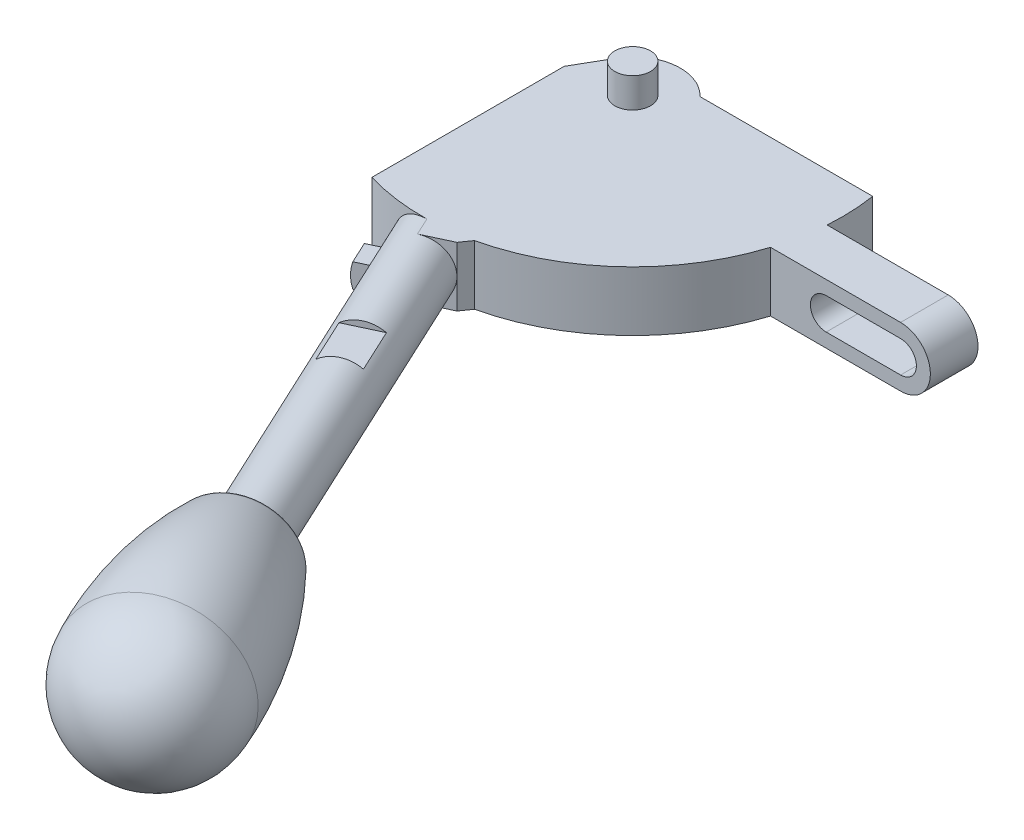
ISO-10303-21;
HEADER;
FILE_DESCRIPTION(('STEP AP214'),'2;1');
FILE_NAME('part.step','',(''),(''),'','','');
FILE_SCHEMA(('AUTOMOTIVE_DESIGN { 1 0 10303 214 1 1 1 1 }'));
ENDSEC;
DATA;
#1=APPLICATION_CONTEXT('core data for automotive mechanical design processes');
#2=APPLICATION_PROTOCOL_DEFINITION('international standard','automotive_design',2000,#1);
#3=PRODUCT_CONTEXT('',#1,'mechanical');
#4=PRODUCT('Part','Part','',(#3));
#5=PRODUCT_RELATED_PRODUCT_CATEGORY('part','',(#4));
#6=PRODUCT_DEFINITION_FORMATION('','',#4);
#7=PRODUCT_DEFINITION_CONTEXT('part definition',#1,'design');
#8=PRODUCT_DEFINITION('design','',#6,#7);
#9=PRODUCT_DEFINITION_SHAPE('','',#8);
#10=(LENGTH_UNIT() NAMED_UNIT(*) SI_UNIT(.MILLI.,.METRE.));
#11=(NAMED_UNIT(*) PLANE_ANGLE_UNIT() SI_UNIT($,.RADIAN.));
#12=(NAMED_UNIT(*) SI_UNIT($,.STERADIAN.) SOLID_ANGLE_UNIT());
#13=UNCERTAINTY_MEASURE_WITH_UNIT(LENGTH_MEASURE(1.E-05),#10,'distance_accuracy_value','');
#14=(GEOMETRIC_REPRESENTATION_CONTEXT(3) GLOBAL_UNCERTAINTY_ASSIGNED_CONTEXT((#13)) GLOBAL_UNIT_ASSIGNED_CONTEXT((#10,
#11,#12)) REPRESENTATION_CONTEXT('',''));
#15=CARTESIAN_POINT('',(0.,0.,0.));
#16=DIRECTION('',(0.,0.,1.));
#17=DIRECTION('',(1.,0.,0.));
#18=AXIS2_PLACEMENT_3D('',#15,#16,#17);
#19=CARTESIAN_POINT('',(40.5255103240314,0.,120.692352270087));
#20=DIRECTION('',(-0.905029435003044,-0.053094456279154,0.422022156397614));
#21=DIRECTION('',(0.422618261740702,0.,0.906307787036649));
#22=AXIS2_PLACEMENT_3D('',#19,#20,#21);
#23=SPHERICAL_SURFACE('',#22,13.);
#24=CARTESIAN_POINT('',(40.5255103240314,0.,120.692352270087));
#25=DIRECTION('',(-0.422618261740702,0.,-0.906307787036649));
#26=DIRECTION('',(-0.905029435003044,-0.053094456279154,0.422022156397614));
#27=AXIS2_PLACEMENT_3D('',#24,#25,#26);
#28=SPHERICAL_SURFACE('',#27,13.);
#29=CARTESIAN_POINT('',(40.5255103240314,0.,120.692352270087));
#30=DIRECTION('',(-0.422618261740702,0.,-0.906307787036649));
#31=DIRECTION('',(-0.905029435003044,-0.053094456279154,0.422022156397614));
#32=AXIS2_PLACEMENT_3D('',#29,#30,#31);
#33=CIRCLE('',#32,13.);
#34=CARTESIAN_POINT('',(28.7601276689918,-0.690227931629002,126.178640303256));
#35=VERTEX_POINT('',#34);
#36=EDGE_CURVE('E627',#35,#35,#33,.T.);
#37=ORIENTED_EDGE('',*,*,#36,.F.);
#38=EDGE_LOOP('',(#37));
#39=FACE_BOUND('',#38,.T.);
#40=ADVANCED_FACE('F15',(#39),#28,.T.);
#41=CARTESIAN_POINT('',(39.4938461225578,0.,118.479941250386));
#42=DIRECTION('',(-0.422618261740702,0.,-0.906307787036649));
#43=DIRECTION('',(-0.905029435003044,-0.053094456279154,0.422022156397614));
#44=AXIS2_PLACEMENT_3D('',#41,#42,#43);
#45=DEGENERATE_TOROIDAL_SURFACE('',#44,66.9627469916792,80.,.F.);
#46=CARTESIAN_POINT('',(28.5554692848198,0.,95.0225164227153));
#47=DIRECTION('',(-0.422618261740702,0.,-0.906307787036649));
#48=DIRECTION('',(-0.905029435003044,-0.053094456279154,0.422022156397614));
#49=AXIS2_PLACEMENT_3D('',#46,#47,#48);
#50=CIRCLE('',#49,8.73468448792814);
#51=CARTESIAN_POINT('',(20.6503227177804,-0.463763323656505,98.7087468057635));
#52=VERTEX_POINT('',#51);
#53=EDGE_CURVE('E629',#52,#52,#50,.T.);
#54=ORIENTED_EDGE('',*,*,#53,.F.);
#55=EDGE_LOOP('',(#54));
#56=FACE_BOUND('',#55,.T.);
#57=ORIENTED_EDGE('',*,*,#36,.T.);
#58=EDGE_LOOP('',(#57));
#59=FACE_BOUND('',#58,.T.);
#60=ADVANCED_FACE('F600',(#56,#59),#45,.F.);
#61=CARTESIAN_POINT('',(28.6921989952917,0.,95.3157342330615));
#62=DIRECTION('',(-0.422618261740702,0.,-0.906307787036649));
#63=DIRECTION('',(-0.905029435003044,-0.053094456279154,0.422022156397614));
#64=AXIS2_PLACEMENT_3D('',#61,#62,#63);
#65=TOROIDAL_SURFACE('',#64,7.78846659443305,1.);
#66=CARTESIAN_POINT('',(28.269580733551,0.,94.4094264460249));
#67=DIRECTION('',(-0.422618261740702,0.,-0.906307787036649));
#68=DIRECTION('',(-0.905029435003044,-0.053094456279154,0.422022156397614));
#69=AXIS2_PLACEMENT_3D('',#66,#67,#68);
#70=CIRCLE('',#69,7.78846659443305);
#71=CARTESIAN_POINT('',(21.2207892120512,-0.413524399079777,97.6963319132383));
#72=VERTEX_POINT('',#71);
#73=EDGE_CURVE('E25',#72,#72,#70,.T.);
#74=ORIENTED_EDGE('',*,*,#73,.F.);
#75=EDGE_LOOP('',(#74));
#76=FACE_BOUND('',#75,.T.);
#77=ORIENTED_EDGE('',*,*,#53,.T.);
#78=EDGE_LOOP('',(#77));
#79=FACE_BOUND('',#78,.T.);
#80=ADVANCED_FACE('F456',(#76,#79),#65,.T.);
#81=CARTESIAN_POINT('',(27.8948003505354,7.77748092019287,94.5841894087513));
#82=DIRECTION('',(0.422618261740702,0.,0.906307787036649));
#83=DIRECTION('',(0.905029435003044,0.053094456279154,-0.422022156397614));
#84=AXIS2_PLACEMENT_3D('',#81,#82,#83);
#85=PLANE('',#84);
#86=ORIENTED_EDGE('',*,*,#73,.T.);
#87=EDGE_LOOP('',(#86));
#88=FACE_BOUND('',#87,.T.);
#89=CARTESIAN_POINT('',(28.269580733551,0.,94.4094264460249));
#90=DIRECTION('',(0.422618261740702,0.,0.906307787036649));
#91=DIRECTION('',(-0.906307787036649,0.,0.422618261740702));
#92=AXIS2_PLACEMENT_3D('',#89,#90,#91);
#93=CIRCLE('',#92,5.);
#94=CARTESIAN_POINT('',(23.7380417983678,0.,96.5225177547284));
#95=VERTEX_POINT('',#94);
#96=EDGE_CURVE('E9',#95,#95,#93,.F.);
#97=ORIENTED_EDGE('',*,*,#96,.F.);
#98=EDGE_LOOP('',(#97));
#99=FACE_BOUND('',#98,.T.);
#100=ADVANCED_FACE('F444',(#88,#99),#85,.F.);
#101=CARTESIAN_POINT('',(0.,10.,0.));
#102=DIRECTION('',(0.,-1.,0.));
#103=DIRECTION('',(0.,0.,-1.));
#104=AXIS2_PLACEMENT_3D('',#101,#102,#103);
#105=PLANE('',#104);
#106=CARTESIAN_POINT('',(0.,10.,0.));
#107=DIRECTION('',(0.,-1.,0.));
#108=DIRECTION('',(0.,0.,-1.));
#109=AXIS2_PLACEMENT_3D('',#106,#107,#108);
#110=CIRCLE('',#109,3.);
#111=CARTESIAN_POINT('',(0.,10.,-3.));
#112=VERTEX_POINT('',#111);
#113=EDGE_CURVE('E215',#112,#112,#110,.T.);
#114=ORIENTED_EDGE('',*,*,#113,.F.);
#115=EDGE_LOOP('',(#114));
#116=FACE_BOUND('',#115,.T.);
#117=ADVANCED_FACE('F442',(#116),#105,.F.);
#118=CARTESIAN_POINT('',(0.,-10.,0.));
#119=DIRECTION('',(0.,1.,0.));
#120=DIRECTION('',(0.,0.,1.));
#121=AXIS2_PLACEMENT_3D('',#118,#119,#120);
#122=PLANE('',#121);
#123=CARTESIAN_POINT('',(0.,-10.,0.));
#124=DIRECTION('',(0.,-1.,0.));
#125=DIRECTION('',(0.,0.,-1.));
#126=AXIS2_PLACEMENT_3D('',#123,#124,#125);
#127=CIRCLE('',#126,3.);
#128=CARTESIAN_POINT('',(0.,-10.,-3.));
#129=VERTEX_POINT('',#128);
#130=EDGE_CURVE('E639',#129,#129,#127,.T.);
#131=ORIENTED_EDGE('',*,*,#130,.T.);
#132=EDGE_LOOP('',(#131));
#133=FACE_BOUND('',#132,.T.);
#134=ADVANCED_FACE('F440',(#133),#122,.F.);
#135=CARTESIAN_POINT('',(43.,0.,10.5));
#136=DIRECTION('',(0.,0.,-1.));
#137=DIRECTION('',(0.,1.,0.));
#138=AXIS2_PLACEMENT_3D('',#135,#136,#137);
#139=CYLINDRICAL_SURFACE('',#138,2.65);
#140=CARTESIAN_POINT('',(43.,0.,2.49999999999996));
#141=DIRECTION('',(0.,0.,-1.));
#142=DIRECTION('',(0.,1.,0.));
#143=AXIS2_PLACEMENT_3D('',#140,#141,#142);
#144=CIRCLE('',#143,2.65);
#145=CARTESIAN_POINT('',(43.,-2.65,2.49999999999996));
#146=VERTEX_POINT('',#145);
#147=CARTESIAN_POINT('',(43.,2.65,2.49999999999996));
#148=VERTEX_POINT('',#147);
#149=EDGE_CURVE('E243',#146,#148,#144,.T.);
#150=ORIENTED_EDGE('',*,*,#149,.T.);
#151=DIRECTION('',(0.,0.,-1.));
#152=VECTOR('',#151,1.);
#153=CARTESIAN_POINT('',(43.,2.65,10.5));
#154=LINE('',#153,#152);
#155=CARTESIAN_POINT('',(43.,2.65,10.5));
#156=VERTEX_POINT('',#155);
#157=EDGE_CURVE('E251',#156,#148,#154,.T.);
#158=ORIENTED_EDGE('',*,*,#157,.F.);
#159=CARTESIAN_POINT('',(43.,0.,10.5));
#160=DIRECTION('',(0.,0.,-1.));
#161=DIRECTION('',(0.,1.,0.));
#162=AXIS2_PLACEMENT_3D('',#159,#160,#161);
#163=CIRCLE('',#162,2.65);
#164=CARTESIAN_POINT('',(43.,-2.65,10.5));
#165=VERTEX_POINT('',#164);
#166=EDGE_CURVE('E166',#165,#156,#163,.T.);
#167=ORIENTED_EDGE('',*,*,#166,.F.);
#168=DIRECTION('',(0.,0.,-1.));
#169=VECTOR('',#168,1.);
#170=CARTESIAN_POINT('',(43.,-2.65,10.5));
#171=LINE('',#170,#169);
#172=EDGE_CURVE('E253',#165,#146,#171,.T.);
#173=ORIENTED_EDGE('',*,*,#172,.T.);
#174=EDGE_LOOP('',(#150,#158,#167,#173));
#175=FACE_BOUND('',#174,.T.);
#176=ADVANCED_FACE('F426',(#175),#139,.F.);
#177=CARTESIAN_POINT('',(55.5,2.65,10.5));
#178=DIRECTION('',(0.,1.,0.));
#179=DIRECTION('',(1.,0.,0.));
#180=AXIS2_PLACEMENT_3D('',#177,#178,#179);
#181=PLANE('',#180);
#182=DIRECTION('',(1.,0.,0.));
#183=VECTOR('',#182,1.);
#184=CARTESIAN_POINT('',(55.5,2.65,2.49999999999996));
#185=LINE('',#184,#183);
#186=CARTESIAN_POINT('',(55.5,2.65,2.49999999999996));
#187=VERTEX_POINT('',#186);
#188=EDGE_CURVE('E231',#148,#187,#185,.T.);
#189=ORIENTED_EDGE('',*,*,#188,.T.);
#190=DIRECTION('',(0.,0.,-1.));
#191=VECTOR('',#190,1.);
#192=CARTESIAN_POINT('',(55.5,2.65,10.5));
#193=LINE('',#192,#191);
#194=CARTESIAN_POINT('',(55.5,2.65,10.5));
#195=VERTEX_POINT('',#194);
#196=EDGE_CURVE('E248',#195,#187,#193,.T.);
#197=ORIENTED_EDGE('',*,*,#196,.F.);
#198=DIRECTION('',(1.,0.,0.));
#199=VECTOR('',#198,1.);
#200=CARTESIAN_POINT('',(55.5,2.65,10.5));
#201=LINE('',#200,#199);
#202=EDGE_CURVE('E235',#156,#195,#201,.T.);
#203=ORIENTED_EDGE('',*,*,#202,.F.);
#204=ORIENTED_EDGE('',*,*,#157,.T.);
#205=EDGE_LOOP('',(#189,#197,#203,#204));
#206=FACE_BOUND('',#205,.T.);
#207=ADVANCED_FACE('F439',(#206),#181,.F.);
#208=CARTESIAN_POINT('',(55.5,0.,10.5));
#209=DIRECTION('',(0.,0.,-1.));
#210=DIRECTION('',(0.,1.,0.));
#211=AXIS2_PLACEMENT_3D('',#208,#209,#210);
#212=CYLINDRICAL_SURFACE('',#211,2.65);
#213=CARTESIAN_POINT('',(55.5,0.,2.49999999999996));
#214=DIRECTION('',(0.,0.,-1.));
#215=DIRECTION('',(0.,1.,0.));
#216=AXIS2_PLACEMENT_3D('',#213,#214,#215);
#217=CIRCLE('',#216,2.65);
#218=CARTESIAN_POINT('',(55.5,-2.65,2.49999999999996));
#219=VERTEX_POINT('',#218);
#220=EDGE_CURVE('E160',#187,#219,#217,.T.);
#221=ORIENTED_EDGE('',*,*,#220,.T.);
#222=DIRECTION('',(0.,0.,-1.));
#223=VECTOR('',#222,1.);
#224=CARTESIAN_POINT('',(55.5,-2.65,10.5));
#225=LINE('',#224,#223);
#226=CARTESIAN_POINT('',(55.5,-2.65,10.5));
#227=VERTEX_POINT('',#226);
#228=EDGE_CURVE('E238',#227,#219,#225,.T.);
#229=ORIENTED_EDGE('',*,*,#228,.F.);
#230=CARTESIAN_POINT('',(55.5,0.,10.5));
#231=DIRECTION('',(0.,0.,-1.));
#232=DIRECTION('',(0.,1.,0.));
#233=AXIS2_PLACEMENT_3D('',#230,#231,#232);
#234=CIRCLE('',#233,2.65);
#235=EDGE_CURVE('E227',#195,#227,#234,.T.);
#236=ORIENTED_EDGE('',*,*,#235,.F.);
#237=ORIENTED_EDGE('',*,*,#196,.T.);
#238=EDGE_LOOP('',(#221,#229,#236,#237));
#239=FACE_BOUND('',#238,.T.);
#240=ADVANCED_FACE('F473',(#239),#212,.F.);
#241=CARTESIAN_POINT('',(55.5,-2.65,10.5));
#242=DIRECTION('',(0.,-1.,0.));
#243=DIRECTION('',(-1.,0.,0.));
#244=AXIS2_PLACEMENT_3D('',#241,#242,#243);
#245=PLANE('',#244);
#246=DIRECTION('',(-1.,0.,0.));
#247=VECTOR('',#246,1.);
#248=CARTESIAN_POINT('',(55.5,-2.65,2.49999999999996));
#249=LINE('',#248,#247);
#250=EDGE_CURVE('E240',#219,#146,#249,.T.);
#251=ORIENTED_EDGE('',*,*,#250,.T.);
#252=ORIENTED_EDGE('',*,*,#172,.F.);
#253=DIRECTION('',(-1.,0.,0.));
#254=VECTOR('',#253,1.);
#255=CARTESIAN_POINT('',(55.5,-2.65,10.5));
#256=LINE('',#255,#254);
#257=EDGE_CURVE('E230',#227,#165,#256,.T.);
#258=ORIENTED_EDGE('',*,*,#257,.F.);
#259=ORIENTED_EDGE('',*,*,#228,.T.);
#260=EDGE_LOOP('',(#251,#252,#258,#259));
#261=FACE_BOUND('',#260,.T.);
#262=ADVANCED_FACE('F463',(#261),#245,.F.);
#263=CARTESIAN_POINT('',(0.,-28.9436627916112,0.));
#264=DIRECTION('',(0.,-1.,0.));
#265=DIRECTION('',(0.,0.,-1.));
#266=AXIS2_PLACEMENT_3D('',#263,#264,#265);
#267=CYLINDRICAL_SURFACE('',#266,3.);
#268=CARTESIAN_POINT('',(0.,5.,0.));
#269=DIRECTION('',(0.,1.,0.));
#270=DIRECTION('',(-1.,0.,0.));
#271=AXIS2_PLACEMENT_3D('',#268,#269,#270);
#272=CIRCLE('',#271,3.);
#273=CARTESIAN_POINT('',(-3.,5.,0.));
#274=VERTEX_POINT('',#273);
#275=EDGE_CURVE('E642',#274,#274,#272,.T.);
#276=ORIENTED_EDGE('',*,*,#275,.T.);
#277=EDGE_LOOP('',(#276));
#278=FACE_BOUND('',#277,.T.);
#279=ORIENTED_EDGE('',*,*,#113,.T.);
#280=EDGE_LOOP('',(#279));
#281=FACE_BOUND('',#280,.T.);
#282=ADVANCED_FACE('F447',(#278,#281),#267,.T.);
#283=CARTESIAN_POINT('',(0.,-5.,0.));
#284=DIRECTION('',(0.,-1.,0.));
#285=DIRECTION('',(0.,0.,-1.));
#286=AXIS2_PLACEMENT_3D('',#283,#284,#285);
#287=CIRCLE('',#286,3.);
#288=CARTESIAN_POINT('',(0.,-5.,-3.));
#289=VERTEX_POINT('',#288);
#290=EDGE_CURVE('E634',#289,#289,#287,.T.);
#291=ORIENTED_EDGE('',*,*,#290,.T.);
#292=EDGE_LOOP('',(#291));
#293=FACE_BOUND('',#292,.T.);
#294=ORIENTED_EDGE('',*,*,#130,.F.);
#295=EDGE_LOOP('',(#294));
#296=FACE_BOUND('',#295,.T.);
#297=ADVANCED_FACE('F455',(#293,#296),#267,.T.);
#298=CARTESIAN_POINT('',(0.,-5.,0.));
#299=DIRECTION('',(0.,1.,0.));
#300=DIRECTION('',(0.,0.,1.));
#301=AXIS2_PLACEMENT_3D('',#298,#299,#300);
#302=CYLINDRICAL_SURFACE('',#301,35.25);
#303=CARTESIAN_POINT('',(0.,5.,0.));
#304=DIRECTION('',(0.,-1.,0.));
#305=DIRECTION('',(0.,0.,-1.));
#306=AXIS2_PLACEMENT_3D('',#303,#304,#305);
#307=CIRCLE('',#306,35.25);
#308=CARTESIAN_POINT('',(34.818278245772,5.,-5.5));
#309=VERTEX_POINT('',#308);
#310=CARTESIAN_POINT('',(35.1612357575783,5.,2.5));
#311=VERTEX_POINT('',#310);
#312=EDGE_CURVE('E296',#309,#311,#307,.T.);
#313=ORIENTED_EDGE('',*,*,#312,.T.);
#314=DIRECTION('',(0.,1.,0.));
#315=VECTOR('',#314,1.);
#316=CARTESIAN_POINT('',(35.1612357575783,-5.,2.5));
#317=LINE('',#316,#315);
#318=CARTESIAN_POINT('',(35.1612357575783,-5.,2.5));
#319=VERTEX_POINT('',#318);
#320=EDGE_CURVE('E301',#319,#311,#317,.T.);
#321=ORIENTED_EDGE('',*,*,#320,.F.);
#322=CARTESIAN_POINT('',(0.,-5.,0.));
#323=DIRECTION('',(0.,-1.,0.));
#324=DIRECTION('',(0.,0.,-1.));
#325=AXIS2_PLACEMENT_3D('',#322,#323,#324);
#326=CIRCLE('',#325,35.25);
#327=CARTESIAN_POINT('',(34.818278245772,-5.,-5.5));
#328=VERTEX_POINT('',#327);
#329=EDGE_CURVE('E281',#328,#319,#326,.T.);
#330=ORIENTED_EDGE('',*,*,#329,.F.);
#331=DIRECTION('',(0.,1.,0.));
#332=VECTOR('',#331,1.);
#333=CARTESIAN_POINT('',(34.818278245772,-5.,-5.5));
#334=LINE('',#333,#332);
#335=EDGE_CURVE('E304',#328,#309,#334,.T.);
#336=ORIENTED_EDGE('',*,*,#335,.T.);
#337=EDGE_LOOP('',(#313,#321,#330,#336));
#338=FACE_BOUND('',#337,.T.);
#339=ADVANCED_FACE('F470',(#338),#302,.T.);
#340=CARTESIAN_POINT('',(34.818278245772,-5.,-5.5));
#341=DIRECTION('',(0.,0.,1.));
#342=DIRECTION('',(1.,0.,0.));
#343=AXIS2_PLACEMENT_3D('',#340,#341,#342);
#344=PLANE('',#343);
#345=DIRECTION('',(1.,0.,0.));
#346=VECTOR('',#345,1.);
#347=CARTESIAN_POINT('',(34.818278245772,5.,-5.5));
#348=LINE('',#347,#346);
#349=CARTESIAN_POINT('',(5.80947501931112,5.,-5.50000000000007));
#350=VERTEX_POINT('',#349);
#351=EDGE_CURVE('E293',#350,#309,#348,.T.);
#352=ORIENTED_EDGE('',*,*,#351,.T.);
#353=ORIENTED_EDGE('',*,*,#335,.F.);
#354=DIRECTION('',(1.,0.,0.));
#355=VECTOR('',#354,1.);
#356=CARTESIAN_POINT('',(34.818278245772,-5.,-5.5));
#357=LINE('',#356,#355);
#358=CARTESIAN_POINT('',(5.80947501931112,-5.,-5.50000000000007));
#359=VERTEX_POINT('',#358);
#360=EDGE_CURVE('E278',#359,#328,#357,.T.);
#361=ORIENTED_EDGE('',*,*,#360,.F.);
#362=DIRECTION('',(0.,1.,0.));
#363=VECTOR('',#362,1.);
#364=CARTESIAN_POINT('',(5.80947501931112,-5.,-5.50000000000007));
#365=LINE('',#364,#363);
#366=EDGE_CURVE('E306',#359,#350,#365,.T.);
#367=ORIENTED_EDGE('',*,*,#366,.T.);
#368=EDGE_LOOP('',(#352,#353,#361,#367));
#369=FACE_BOUND('',#368,.T.);
#370=ADVANCED_FACE('F798',(#369),#344,.F.);
#371=CARTESIAN_POINT('',(0.,-5.,0.));
#372=DIRECTION('',(0.,1.,0.));
#373=DIRECTION('',(0.,0.,1.));
#374=AXIS2_PLACEMENT_3D('',#371,#372,#373);
#375=CYLINDRICAL_SURFACE('',#374,8.);
#376=CARTESIAN_POINT('',(0.,5.,0.));
#377=DIRECTION('',(0.,-1.,0.));
#378=DIRECTION('',(0.,0.,1.));
#379=AXIS2_PLACEMENT_3D('',#376,#377,#378);
#380=CIRCLE('',#379,8.);
#381=CARTESIAN_POINT('',(-6.25301106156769,5.,-4.98997521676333));
#382=VERTEX_POINT('',#381);
#383=EDGE_CURVE('E291',#382,#350,#380,.T.);
#384=ORIENTED_EDGE('',*,*,#383,.T.);
#385=ORIENTED_EDGE('',*,*,#366,.F.);
#386=CARTESIAN_POINT('',(0.,-5.,0.));
#387=DIRECTION('',(0.,-1.,0.));
#388=DIRECTION('',(0.,0.,1.));
#389=AXIS2_PLACEMENT_3D('',#386,#387,#388);
#390=CIRCLE('',#389,8.);
#391=CARTESIAN_POINT('',(-6.25301106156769,-5.,-4.98997521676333));
#392=VERTEX_POINT('',#391);
#393=EDGE_CURVE('E274',#392,#359,#390,.T.);
#394=ORIENTED_EDGE('',*,*,#393,.F.);
#395=DIRECTION('',(0.,1.,0.));
#396=VECTOR('',#395,1.);
#397=CARTESIAN_POINT('',(-6.25301106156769,-5.,-4.98997521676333));
#398=LINE('',#397,#396);
#399=EDGE_CURVE('E309',#392,#382,#398,.T.);
#400=ORIENTED_EDGE('',*,*,#399,.T.);
#401=EDGE_LOOP('',(#384,#385,#394,#400));
#402=FACE_BOUND('',#401,.T.);
#403=ADVANCED_FACE('F788',(#402),#375,.T.);
#404=CARTESIAN_POINT('',(-10.,-5.,1.50000000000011));
#405=DIRECTION('',(0.866025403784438,0.,0.5));
#406=DIRECTION('',(0.5,0.,-0.866025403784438));
#407=AXIS2_PLACEMENT_3D('',#404,#405,#406);
#408=PLANE('',#407);
#409=DIRECTION('',(0.5,0.,-0.866025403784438));
#410=VECTOR('',#409,1.);
#411=CARTESIAN_POINT('',(-10.,5.,1.50000000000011));
#412=LINE('',#411,#410);
#413=CARTESIAN_POINT('',(-10.,5.,1.50000000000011));
#414=VERTEX_POINT('',#413);
#415=EDGE_CURVE('E288',#414,#382,#412,.T.);
#416=ORIENTED_EDGE('',*,*,#415,.T.);
#417=ORIENTED_EDGE('',*,*,#399,.F.);
#418=DIRECTION('',(0.5,0.,-0.866025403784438));
#419=VECTOR('',#418,1.);
#420=CARTESIAN_POINT('',(-10.,-5.,1.50000000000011));
#421=LINE('',#420,#419);
#422=CARTESIAN_POINT('',(-10.,-5.,1.50000000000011));
#423=VERTEX_POINT('',#422);
#424=EDGE_CURVE('E271',#423,#392,#421,.T.);
#425=ORIENTED_EDGE('',*,*,#424,.F.);
#426=DIRECTION('',(0.,1.,0.));
#427=VECTOR('',#426,1.);
#428=CARTESIAN_POINT('',(-10.,-5.,1.50000000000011));
#429=LINE('',#428,#427);
#430=EDGE_CURVE('E287',#423,#414,#429,.T.);
#431=ORIENTED_EDGE('',*,*,#430,.T.);
#432=EDGE_LOOP('',(#416,#417,#425,#431));
#433=FACE_BOUND('',#432,.T.);
#434=ADVANCED_FACE('F747',(#433),#408,.F.);
#435=CARTESIAN_POINT('',(6.59878744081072,-5.,36.1052523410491));
#436=DIRECTION('',(-0.819152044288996,0.,-0.573576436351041));
#437=DIRECTION('',(-0.573576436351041,0.,0.819152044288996));
#438=AXIS2_PLACEMENT_3D('',#435,#436,#437);
#439=PLANE('',#438);
#440=DIRECTION('',(-0.573576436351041,0.,0.819152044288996));
#441=VECTOR('',#440,1.);
#442=CARTESIAN_POINT('',(6.59878744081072,5.,36.1052523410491));
#443=LINE('',#442,#441);
#444=CARTESIAN_POINT('',(7.81128334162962,5.,34.3736287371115));
#445=VERTEX_POINT('',#444);
#446=CARTESIAN_POINT('',(6.59878744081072,5.,36.1052523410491));
#447=VERTEX_POINT('',#446);
#448=EDGE_CURVE('E330',#445,#447,#443,.T.);
#449=ORIENTED_EDGE('',*,*,#448,.T.);
#450=DIRECTION('',(0.,1.,0.));
#451=VECTOR('',#450,1.);
#452=CARTESIAN_POINT('',(6.59878744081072,-5.,36.1052523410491));
#453=LINE('',#452,#451);
#454=CARTESIAN_POINT('',(6.59878744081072,0.,36.1052523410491));
#455=VERTEX_POINT('',#454);
#456=EDGE_CURVE('E342',#455,#447,#453,.T.);
#457=ORIENTED_EDGE('',*,*,#456,.F.);
#458=CARTESIAN_POINT('',(6.59878744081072,-5.,36.1052523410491));
#459=VERTEX_POINT('',#458);
#460=EDGE_CURVE('E339',#459,#455,#453,.T.);
#461=ORIENTED_EDGE('',*,*,#460,.F.);
#462=DIRECTION('',(-0.573576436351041,0.,0.819152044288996));
#463=VECTOR('',#462,1.);
#464=CARTESIAN_POINT('',(6.59878744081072,-5.,36.1052523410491));
#465=LINE('',#464,#463);
#466=CARTESIAN_POINT('',(7.81128334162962,-5.,34.3736287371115));
#467=VERTEX_POINT('',#466);
#468=EDGE_CURVE('E318',#467,#459,#465,.T.);
#469=ORIENTED_EDGE('',*,*,#468,.F.);
#470=DIRECTION('',(0.,1.,0.));
#471=VECTOR('',#470,1.);
#472=CARTESIAN_POINT('',(7.81128334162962,-5.,34.3736287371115));
#473=LINE('',#472,#471);
#474=EDGE_CURVE('E343',#467,#445,#473,.T.);
#475=ORIENTED_EDGE('',*,*,#474,.T.);
#476=EDGE_LOOP('',(#449,#457,#461,#469,#475));
#477=FACE_BOUND('',#476,.T.);
#478=ADVANCED_FACE('F720',(#477),#439,.F.);
#479=CARTESIAN_POINT('',(0.,-5.,0.));
#480=DIRECTION('',(0.,1.,0.));
#481=DIRECTION('',(0.,0.,1.));
#482=AXIS2_PLACEMENT_3D('',#479,#480,#481);
#483=CYLINDRICAL_SURFACE('',#482,35.25);
#484=CARTESIAN_POINT('',(0.,5.,0.));
#485=DIRECTION('',(0.,-1.,0.));
#486=DIRECTION('',(0.,0.,-1.));
#487=AXIS2_PLACEMENT_3D('',#484,#485,#486);
#488=CIRCLE('',#487,35.25);
#489=CARTESIAN_POINT('',(33.6498514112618,5.,10.5));
#490=VERTEX_POINT('',#489);
#491=EDGE_CURVE('E327',#490,#445,#488,.T.);
#492=ORIENTED_EDGE('',*,*,#491,.T.);
#493=ORIENTED_EDGE('',*,*,#474,.F.);
#494=CARTESIAN_POINT('',(0.,-5.,0.));
#495=DIRECTION('',(0.,-1.,0.));
#496=DIRECTION('',(0.,0.,-1.));
#497=AXIS2_PLACEMENT_3D('',#494,#495,#496);
#498=CIRCLE('',#497,35.25);
#499=CARTESIAN_POINT('',(33.6498514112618,-5.,10.5));
#500=VERTEX_POINT('',#499);
#501=EDGE_CURVE('E314',#500,#467,#498,.T.);
#502=ORIENTED_EDGE('',*,*,#501,.F.);
#503=DIRECTION('',(0.,1.,0.));
#504=VECTOR('',#503,1.);
#505=CARTESIAN_POINT('',(33.6498514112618,-5.,10.5));
#506=LINE('',#505,#504);
#507=EDGE_CURVE('E325',#500,#490,#506,.T.);
#508=ORIENTED_EDGE('',*,*,#507,.T.);
#509=EDGE_LOOP('',(#492,#493,#502,#508));
#510=FACE_BOUND('',#509,.T.);
#511=ADVANCED_FACE('F760',(#510),#483,.T.);
#512=CARTESIAN_POINT('',(33.6498514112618,-5.,10.5));
#513=DIRECTION('',(0.,0.,-1.));
#514=DIRECTION('',(0.,1.,0.));
#515=AXIS2_PLACEMENT_3D('',#512,#513,#514);
#516=PLANE('',#515);
#517=ORIENTED_EDGE('',*,*,#202,.T.);
#518=ORIENTED_EDGE('',*,*,#235,.T.);
#519=ORIENTED_EDGE('',*,*,#257,.T.);
#520=ORIENTED_EDGE('',*,*,#166,.T.);
#521=EDGE_LOOP('',(#517,#518,#519,#520));
#522=FACE_BOUND('',#521,.T.);
#523=DIRECTION('',(-1.,0.,0.));
#524=VECTOR('',#523,1.);
#525=CARTESIAN_POINT('',(33.6498514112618,-5.,10.5));
#526=LINE('',#525,#524);
#527=CARTESIAN_POINT('',(55.5,-5.,10.5));
#528=VERTEX_POINT('',#527);
#529=EDGE_CURVE('E312',#528,#500,#526,.T.);
#530=ORIENTED_EDGE('',*,*,#529,.F.);
#531=CARTESIAN_POINT('',(55.5,0.,10.5));
#532=DIRECTION('',(0.,0.,1.));
#533=DIRECTION('',(0.,1.,0.));
#534=AXIS2_PLACEMENT_3D('',#531,#532,#533);
#535=CIRCLE('',#534,5.);
#536=CARTESIAN_POINT('',(55.5,5.,10.5));
#537=VERTEX_POINT('',#536);
#538=EDGE_CURVE('E218',#528,#537,#535,.T.);
#539=ORIENTED_EDGE('',*,*,#538,.T.);
#540=DIRECTION('',(-1.,0.,0.));
#541=VECTOR('',#540,1.);
#542=CARTESIAN_POINT('',(33.6498514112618,5.,10.5));
#543=LINE('',#542,#541);
#544=EDGE_CURVE('E303',#537,#490,#543,.T.);
#545=ORIENTED_EDGE('',*,*,#544,.T.);
#546=ORIENTED_EDGE('',*,*,#507,.F.);
#547=EDGE_LOOP('',(#530,#539,#545,#546));
#548=FACE_BOUND('',#547,.T.);
#549=ADVANCED_FACE('F502',(#522,#548),#516,.F.);
#550=CARTESIAN_POINT('',(55.5,0.,10.5));
#551=DIRECTION('',(0.,0.,-1.));
#552=DIRECTION('',(0.,1.,0.));
#553=AXIS2_PLACEMENT_3D('',#550,#551,#552);
#554=CYLINDRICAL_SURFACE('',#553,5.);
#555=CARTESIAN_POINT('',(55.5,0.,2.49999999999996));
#556=DIRECTION('',(0.,0.,1.));
#557=DIRECTION('',(1.,0.,0.));
#558=AXIS2_PLACEMENT_3D('',#555,#556,#557);
#559=CIRCLE('',#558,5.);
#560=CARTESIAN_POINT('',(55.5,5.,2.49999999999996));
#561=VERTEX_POINT('',#560);
#562=CARTESIAN_POINT('',(55.5,-5.,2.49999999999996));
#563=VERTEX_POINT('',#562);
#564=EDGE_CURVE('E378',#561,#563,#559,.F.);
#565=ORIENTED_EDGE('',*,*,#564,.F.);
#566=DIRECTION('',(0.,0.,-1.));
#567=VECTOR('',#566,1.);
#568=CARTESIAN_POINT('',(55.5,5.,10.5));
#569=LINE('',#568,#567);
#570=EDGE_CURVE('E221',#537,#561,#569,.T.);
#571=ORIENTED_EDGE('',*,*,#570,.F.);
#572=ORIENTED_EDGE('',*,*,#538,.F.);
#573=DIRECTION('',(0.,0.,-1.));
#574=VECTOR('',#573,1.);
#575=CARTESIAN_POINT('',(55.5,-5.,10.5));
#576=LINE('',#575,#574);
#577=EDGE_CURVE('E222',#528,#563,#576,.T.);
#578=ORIENTED_EDGE('',*,*,#577,.T.);
#579=EDGE_LOOP('',(#565,#571,#572,#578));
#580=FACE_BOUND('',#579,.T.);
#581=ADVANCED_FACE('F498',(#580),#554,.T.);
#582=CARTESIAN_POINT('',(60.5,-5.,2.49999999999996));
#583=DIRECTION('',(0.,0.,1.));
#584=DIRECTION('',(1.,0.,0.));
#585=AXIS2_PLACEMENT_3D('',#582,#583,#584);
#586=PLANE('',#585);
#587=ORIENTED_EDGE('',*,*,#250,.F.);
#588=ORIENTED_EDGE('',*,*,#220,.F.);
#589=ORIENTED_EDGE('',*,*,#188,.F.);
#590=ORIENTED_EDGE('',*,*,#149,.F.);
#591=EDGE_LOOP('',(#587,#588,#589,#590));
#592=FACE_BOUND('',#591,.T.);
#593=ORIENTED_EDGE('',*,*,#564,.T.);
#594=DIRECTION('',(1.,0.,0.));
#595=VECTOR('',#594,1.);
#596=CARTESIAN_POINT('',(60.5,-5.,2.49999999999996));
#597=LINE('',#596,#595);
#598=EDGE_CURVE('E284',#319,#563,#597,.T.);
#599=ORIENTED_EDGE('',*,*,#598,.F.);
#600=ORIENTED_EDGE('',*,*,#320,.T.);
#601=DIRECTION('',(1.,0.,0.));
#602=VECTOR('',#601,1.);
#603=CARTESIAN_POINT('',(60.5,5.,2.49999999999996));
#604=LINE('',#603,#602);
#605=EDGE_CURVE('E275',#311,#561,#604,.T.);
#606=ORIENTED_EDGE('',*,*,#605,.T.);
#607=EDGE_LOOP('',(#593,#599,#600,#606));
#608=FACE_BOUND('',#607,.T.);
#609=ADVANCED_FACE('F501',(#592,#608),#586,.F.);
#610=CARTESIAN_POINT('',(-10.,-5.,45.));
#611=DIRECTION('',(-1.,0.,0.));
#612=DIRECTION('',(0.,1.,0.));
#613=AXIS2_PLACEMENT_3D('',#610,#611,#612);
#614=PLANE('',#613);
#615=ORIENTED_EDGE('',*,*,#430,.F.);
#616=DIRECTION('',(0.,0.,-1.));
#617=VECTOR('',#616,1.);
#618=CARTESIAN_POINT('',(-10.,-5.,45.));
#619=LINE('',#618,#617);
#620=CARTESIAN_POINT('',(-10.,-5.,33.801812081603));
#621=VERTEX_POINT('',#620);
#622=EDGE_CURVE('E338',#621,#423,#619,.T.);
#623=ORIENTED_EDGE('',*,*,#622,.F.);
#624=DIRECTION('',(0.,1.,0.));
#625=VECTOR('',#624,1.);
#626=CARTESIAN_POINT('',(-10.,-5.,33.801812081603));
#627=LINE('',#626,#625);
#628=CARTESIAN_POINT('',(-10.,5.00000000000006,33.801812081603));
#629=VERTEX_POINT('',#628);
#630=EDGE_CURVE('E335',#621,#629,#627,.T.);
#631=ORIENTED_EDGE('',*,*,#630,.T.);
#632=DIRECTION('',(0.,0.,-1.));
#633=VECTOR('',#632,1.);
#634=CARTESIAN_POINT('',(-10.,5.00000000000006,45.));
#635=LINE('',#634,#633);
#636=EDGE_CURVE('E347',#629,#414,#635,.T.);
#637=ORIENTED_EDGE('',*,*,#636,.T.);
#638=EDGE_LOOP('',(#615,#623,#631,#637));
#639=FACE_BOUND('',#638,.T.);
#640=ADVANCED_FACE('F693',(#639),#614,.T.);
#641=CARTESIAN_POINT('',(3.75772155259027,0.,41.8435747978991));
#642=DIRECTION('',(-0.422618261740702,0.,-0.906307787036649));
#643=DIRECTION('',(-0.906307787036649,0.,0.422618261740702));
#644=AXIS2_PLACEMENT_3D('',#641,#642,#643);
#645=CYLINDRICAL_SURFACE('',#644,7.);
#646=CARTESIAN_POINT('',(2.06724850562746,0.,38.2183436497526));
#647=DIRECTION('',(0.422618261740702,0.,0.906307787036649));
#648=DIRECTION('',(0.906307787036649,0.,-0.422618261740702));
#649=AXIS2_PLACEMENT_3D('',#646,#647,#648);
#650=CIRCLE('',#649,7.);
#651=CARTESIAN_POINT('',(-4.01244895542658,2.,41.0533531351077));
#652=VERTEX_POINT('',#651);
#653=CARTESIAN_POINT('',(-4.01244895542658,-2.,41.0533531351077));
#654=VERTEX_POINT('',#653);
#655=EDGE_CURVE('E260',#652,#654,#650,.T.);
#656=ORIENTED_EDGE('',*,*,#655,.T.);
#657=DIRECTION('',(-0.422618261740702,0.,-0.906307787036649));
#658=VECTOR('',#657,1.);
#659=CARTESIAN_POINT('',(-2.32197590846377,-2.,44.6785842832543));
#660=LINE('',#659,#658);
#661=CARTESIAN_POINT('',(-2.32197590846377,-2.,44.6785842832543));
#662=VERTEX_POINT('',#661);
#663=EDGE_CURVE('E263',#662,#654,#660,.T.);
#664=ORIENTED_EDGE('',*,*,#663,.F.);
#665=CARTESIAN_POINT('',(3.75772155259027,0.,41.8435747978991));
#666=DIRECTION('',(0.422618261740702,0.,0.906307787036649));
#667=DIRECTION('',(0.906307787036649,0.,-0.422618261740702));
#668=AXIS2_PLACEMENT_3D('',#665,#666,#667);
#669=CIRCLE('',#668,7.);
#670=CARTESIAN_POINT('',(-2.32197590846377,2.,44.6785842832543));
#671=VERTEX_POINT('',#670);
#672=EDGE_CURVE('E256',#671,#662,#669,.T.);
#673=ORIENTED_EDGE('',*,*,#672,.F.);
#674=DIRECTION('',(-0.422618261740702,0.,-0.906307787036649));
#675=VECTOR('',#674,1.);
#676=CARTESIAN_POINT('',(-2.32197590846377,2.,44.6785842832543));
#677=LINE('',#676,#675);
#678=EDGE_CURVE('E266',#671,#652,#677,.T.);
#679=ORIENTED_EDGE('',*,*,#678,.T.);
#680=EDGE_LOOP('',(#656,#664,#673,#679));
#681=FACE_BOUND('',#680,.T.);
#682=ADVANCED_FACE('F413',(#681),#645,.T.);
#683=CARTESIAN_POINT('',(-10.,5.00000000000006,45.));
#684=DIRECTION('',(0.,1.,0.));
#685=DIRECTION('',(1.,0.,0.));
#686=AXIS2_PLACEMENT_3D('',#683,#684,#685);
#687=PLANE('',#686);
#688=ORIENTED_EDGE('',*,*,#570,.T.);
#689=ORIENTED_EDGE('',*,*,#605,.F.);
#690=ORIENTED_EDGE('',*,*,#312,.F.);
#691=ORIENTED_EDGE('',*,*,#351,.F.);
#692=ORIENTED_EDGE('',*,*,#383,.F.);
#693=ORIENTED_EDGE('',*,*,#415,.F.);
#694=ORIENTED_EDGE('',*,*,#636,.F.);
#695=CARTESIAN_POINT('',(0.,5.,0.));
#696=DIRECTION('',(0.,-1.,0.));
#697=DIRECTION('',(0.,0.,1.));
#698=AXIS2_PLACEMENT_3D('',#695,#696,#697);
#699=CIRCLE('',#698,35.25);
#700=CARTESIAN_POINT('',(0.680028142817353,5.,35.2434399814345));
#701=VERTEX_POINT('',#700);
#702=EDGE_CURVE('E315',#701,#629,#699,.T.);
#703=ORIENTED_EDGE('',*,*,#702,.F.);
#704=DIRECTION('',(-0.422618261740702,0.,-0.906307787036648));
#705=VECTOR('',#704,1.);
#706=CARTESIAN_POINT('',(2.06724850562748,5.,38.2183436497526));
#707=LINE('',#706,#705);
#708=CARTESIAN_POINT('',(2.06724850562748,5.,38.2183436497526));
#709=VERTEX_POINT('',#708);
#710=EDGE_CURVE('E364',#701,#709,#707,.F.);
#711=ORIENTED_EDGE('',*,*,#710,.T.);
#712=DIRECTION('',(-0.906307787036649,0.,0.422618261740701));
#713=VECTOR('',#712,1.);
#714=CARTESIAN_POINT('',(-2.46429042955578,5.,40.3314349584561));
#715=LINE('',#714,#713);
#716=EDGE_CURVE('E333',#447,#709,#715,.T.);
#717=ORIENTED_EDGE('',*,*,#716,.F.);
#718=ORIENTED_EDGE('',*,*,#448,.F.);
#719=ORIENTED_EDGE('',*,*,#491,.F.);
#720=ORIENTED_EDGE('',*,*,#544,.F.);
#721=EDGE_LOOP('',(#688,#689,#690,#691,#692,#693,#694,#703,#711,#717,#718,#719,#720));
#722=FACE_BOUND('',#721,.T.);
#723=ORIENTED_EDGE('',*,*,#275,.F.);
#724=EDGE_LOOP('',(#723));
#725=FACE_BOUND('',#724,.T.);
#726=ADVANCED_FACE('F504',(#722,#725),#687,.T.);
#727=CARTESIAN_POINT('',(-2.46429042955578,-5.,40.3314349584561));
#728=DIRECTION('',(-0.422618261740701,0.,-0.906307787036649));
#729=DIRECTION('',(-0.906307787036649,0.,0.422618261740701));
#730=AXIS2_PLACEMENT_3D('',#727,#728,#729);
#731=PLANE('',#730);
#732=CARTESIAN_POINT('',(2.06724850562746,0.,38.2183436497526));
#733=DIRECTION('',(0.422618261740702,0.,0.906307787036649));
#734=DIRECTION('',(0.906307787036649,0.,-0.422618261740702));
#735=AXIS2_PLACEMENT_3D('',#732,#733,#734);
#736=CIRCLE('',#735,5.);
#737=EDGE_CURVE('E370',#455,#709,#736,.T.);
#738=ORIENTED_EDGE('',*,*,#737,.F.);
#739=ORIENTED_EDGE('',*,*,#456,.T.);
#740=ORIENTED_EDGE('',*,*,#716,.T.);
#741=EDGE_LOOP('',(#738,#739,#740));
#742=FACE_BOUND('',#741,.T.);
#743=ADVANCED_FACE('F694',(#742),#731,.F.);
#744=CARTESIAN_POINT('',(2.06724850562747,-5.,38.2183436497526));
#745=VERTEX_POINT('',#744);
#746=EDGE_CURVE('E374',#745,#455,#736,.T.);
#747=ORIENTED_EDGE('',*,*,#746,.F.);
#748=DIRECTION('',(-0.906307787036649,0.,0.422618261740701));
#749=VECTOR('',#748,1.);
#750=CARTESIAN_POINT('',(-2.46429042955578,-5.,40.3314349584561));
#751=LINE('',#750,#749);
#752=EDGE_CURVE('E321',#459,#745,#751,.T.);
#753=ORIENTED_EDGE('',*,*,#752,.F.);
#754=ORIENTED_EDGE('',*,*,#460,.T.);
#755=EDGE_LOOP('',(#747,#753,#754));
#756=FACE_BOUND('',#755,.T.);
#757=ADVANCED_FACE('F476',(#756),#731,.F.);
#758=CARTESIAN_POINT('',(-10.,-5.,45.));
#759=DIRECTION('',(0.,-1.,0.));
#760=DIRECTION('',(0.,0.,-1.));
#761=AXIS2_PLACEMENT_3D('',#758,#759,#760);
#762=PLANE('',#761);
#763=ORIENTED_EDGE('',*,*,#598,.T.);
#764=ORIENTED_EDGE('',*,*,#577,.F.);
#765=ORIENTED_EDGE('',*,*,#529,.T.);
#766=ORIENTED_EDGE('',*,*,#501,.T.);
#767=ORIENTED_EDGE('',*,*,#468,.T.);
#768=ORIENTED_EDGE('',*,*,#752,.T.);
#769=DIRECTION('',(-0.422618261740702,0.,-0.906307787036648));
#770=VECTOR('',#769,1.);
#771=CARTESIAN_POINT('',(-0.468461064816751,-5.,32.7804969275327));
#772=LINE('',#771,#770);
#773=CARTESIAN_POINT('',(0.680028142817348,-5.,35.2434399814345));
#774=VERTEX_POINT('',#773);
#775=EDGE_CURVE('E350',#745,#774,#772,.T.);
#776=ORIENTED_EDGE('',*,*,#775,.T.);
#777=CARTESIAN_POINT('',(0.,-5.,0.));
#778=DIRECTION('',(0.,-1.,0.));
#779=DIRECTION('',(0.,0.,1.));
#780=AXIS2_PLACEMENT_3D('',#777,#778,#779);
#781=CIRCLE('',#780,35.25);
#782=EDGE_CURVE('E322',#774,#621,#781,.T.);
#783=ORIENTED_EDGE('',*,*,#782,.T.);
#784=ORIENTED_EDGE('',*,*,#622,.T.);
#785=ORIENTED_EDGE('',*,*,#424,.T.);
#786=ORIENTED_EDGE('',*,*,#393,.T.);
#787=ORIENTED_EDGE('',*,*,#360,.T.);
#788=ORIENTED_EDGE('',*,*,#329,.T.);
#789=EDGE_LOOP('',(#763,#764,#765,#766,#767,#768,#776,#783,#784,#785,#786,#787,#788));
#790=FACE_BOUND('',#789,.T.);
#791=ORIENTED_EDGE('',*,*,#290,.F.);
#792=EDGE_LOOP('',(#791));
#793=FACE_BOUND('',#792,.T.);
#794=ADVANCED_FACE('F472',(#790,#793),#762,.T.);
#795=CARTESIAN_POINT('',(0.,-5.,0.));
#796=DIRECTION('',(0.,1.,0.));
#797=DIRECTION('',(0.,0.,1.));
#798=AXIS2_PLACEMENT_3D('',#795,#796,#797);
#799=CYLINDRICAL_SURFACE('',#798,35.25);
#800=ORIENTED_EDGE('',*,*,#702,.T.);
#801=ORIENTED_EDGE('',*,*,#630,.F.);
#802=ORIENTED_EDGE('',*,*,#782,.F.);
#803=CARTESIAN_POINT('',(0.680028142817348,-5.,35.2434399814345));
#804=CARTESIAN_POINT('',(0.509263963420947,-5.00000546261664,35.2467471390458));
#805=CARTESIAN_POINT('',(0.338498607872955,-4.99268485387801,35.2487887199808));
#806=CARTESIAN_POINT('',(-0.00179082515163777,-4.96372613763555,35.250407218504));
#807=CARTESIAN_POINT('',(-0.171315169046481,-4.94209120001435,35.2499846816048));
#808=CARTESIAN_POINT('',(-0.507964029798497,-4.88483674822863,35.2467427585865));
#809=CARTESIAN_POINT('',(-0.675088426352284,-4.84921653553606,35.2439232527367));
#810=CARTESIAN_POINT('',(-1.00579151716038,-4.76433869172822,35.236035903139));
#811=CARTESIAN_POINT('',(-1.16937001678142,-4.71508031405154,35.2309679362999));
#812=CARTESIAN_POINT('',(-1.49177181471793,-4.6032961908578,35.2187895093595));
#813=CARTESIAN_POINT('',(-1.65059713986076,-4.54077619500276,35.2116799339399));
#814=CARTESIAN_POINT('',(-1.96242924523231,-4.4027955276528,35.1956779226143));
#815=CARTESIAN_POINT('',(-2.11543618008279,-4.32733520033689,35.1867855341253));
#816=CARTESIAN_POINT('',(-2.41454528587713,-4.16376419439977,35.1675268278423));
#817=CARTESIAN_POINT('',(-2.56064386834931,-4.07564703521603,35.1571597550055));
#818=CARTESIAN_POINT('',(-2.84462460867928,-3.88713150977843,35.1353225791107));
#819=CARTESIAN_POINT('',(-2.98250647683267,-3.78673271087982,35.1238524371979));
#820=CARTESIAN_POINT('',(-3.24786140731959,-3.57472538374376,35.1003066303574));
#821=CARTESIAN_POINT('',(-3.37539600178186,-3.46319352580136,35.0882353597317));
#822=CARTESIAN_POINT('',(-3.61956978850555,-3.22889079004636,35.0638882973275));
#823=CARTESIAN_POINT('',(-3.7362145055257,-3.10612567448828,35.0516126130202));
#824=CARTESIAN_POINT('',(-3.95704755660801,-2.85001448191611,35.0273693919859));
#825=CARTESIAN_POINT('',(-4.06124765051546,-2.71667859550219,35.0154015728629));
#826=CARTESIAN_POINT('',(-4.25566751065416,-2.44013084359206,34.9923045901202));
#827=CARTESIAN_POINT('',(-4.34589287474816,-2.29692296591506,34.9811750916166));
#828=CARTESIAN_POINT('',(-4.48914128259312,-2.04033960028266,34.9630358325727));
#829=CARTESIAN_POINT('',(-4.54572190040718,-1.92896041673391,34.9557099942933));
#830=CARTESIAN_POINT('',(-4.64970621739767,-1.70195033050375,34.9420303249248));
#831=CARTESIAN_POINT('',(-4.69711198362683,-1.58632039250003,34.9356762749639));
#832=CARTESIAN_POINT('',(-4.78205187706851,-1.35169097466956,34.9241508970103));
#833=CARTESIAN_POINT('',(-4.81960575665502,-1.23269877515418,34.9189772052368));
#834=CARTESIAN_POINT('',(-4.88442215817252,-0.99193185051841,34.909969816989));
#835=CARTESIAN_POINT('',(-4.91168837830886,-0.870158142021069,34.9061356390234));
#836=CARTESIAN_POINT('',(-4.95561537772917,-0.624176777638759,34.8999265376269));
#837=CARTESIAN_POINT('',(-4.97223413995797,-0.499961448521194,34.8975573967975));
#838=CARTESIAN_POINT('',(-4.99442767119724,-0.250497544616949,34.8943880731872));
#839=CARTESIAN_POINT('',(-4.99999999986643,-0.125248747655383,34.8935882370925));
#840=CARTESIAN_POINT('',(-5.00000000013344,0.125132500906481,34.8935882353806));
#841=CARTESIAN_POINT('',(-4.99443801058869,0.250264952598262,34.8943865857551));
#842=CARTESIAN_POINT('',(-4.97227881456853,0.499575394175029,34.8975510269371));
#843=CARTESIAN_POINT('',(-4.95567727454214,0.623752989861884,34.8999177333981));
#844=CARTESIAN_POINT('',(-4.91167797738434,0.87029337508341,34.9061371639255));
#845=CARTESIAN_POINT('',(-4.88426711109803,0.992653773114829,34.909991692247));
#846=CARTESIAN_POINT('',(-4.81906216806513,1.23457034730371,34.9190524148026));
#847=CARTESIAN_POINT('',(-4.78126373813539,1.35412532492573,34.9242591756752));
#848=CARTESIAN_POINT('',(-4.69604694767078,1.58899984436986,34.9358194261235));
#849=CARTESIAN_POINT('',(-4.64867892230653,1.7043379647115,34.9421668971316));
#850=CARTESIAN_POINT('',(-4.54481713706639,1.93078780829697,34.9558275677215));
#851=CARTESIAN_POINT('',(-4.48831988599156,2.04189789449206,34.9631411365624));
#852=CARTESIAN_POINT('',(-4.3061594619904,2.36791730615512,34.9862038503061));
#853=CARTESIAN_POINT('',(-4.16774023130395,2.57575206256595,35.003087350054));
#854=CARTESIAN_POINT('',(-3.85119580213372,2.98336034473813,35.0393767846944));
#855=CARTESIAN_POINT('',(-3.67090183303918,3.18142226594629,35.0588769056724));
#856=CARTESIAN_POINT('',(-3.28349711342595,3.54938976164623,35.0972798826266));
#857=CARTESIAN_POINT('',(-3.07637273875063,3.7192809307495,35.1161824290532));
#858=CARTESIAN_POINT('',(-2.60748760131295,4.05282652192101,35.1543293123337));
#859=CARTESIAN_POINT('',(-2.34221132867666,4.21158151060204,35.1731864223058));
#860=CARTESIAN_POINT('',(-1.79032282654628,4.48741303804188,35.2055899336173));
#861=CARTESIAN_POINT('',(-1.50370078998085,4.6044702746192,35.2191338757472));
#862=CARTESIAN_POINT('',(-1.05776907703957,4.74892611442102,35.2344577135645));
#863=CARTESIAN_POINT('',(-0.903558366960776,4.79236447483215,35.2387623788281));
#864=CARTESIAN_POINT('',(-0.592165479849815,4.86719815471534,35.2453692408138));
#865=CARTESIAN_POINT('',(-0.434983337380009,4.89859361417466,35.247671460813));
#866=CARTESIAN_POINT('',(-0.118671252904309,4.94903301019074,35.2501545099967));
#867=CARTESIAN_POINT('',(0.0404582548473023,4.96807965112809,35.2503358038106));
#868=CARTESIAN_POINT('',(0.359734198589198,4.99356582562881,35.2485283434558));
#869=CARTESIAN_POINT('',(0.519880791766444,5.00000336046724,35.2465392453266));
#870=CARTESIAN_POINT('',(0.680028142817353,5.,35.2434399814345));
#871=B_SPLINE_CURVE_WITH_KNOTS('',3,(#803,#804,#805,#806,#807,#808,#809,#810,#811,#812,#813,
#814,#815,#816,#817,#818,#819,#820,#821,#822,#823,#824,#825,#826,#827,#828,#829,#830,#831,#832,
#833,#834,#835,#836,#837,#838,#839,#840,#841,#842,#843,#844,#845,#846,#847,#848,#849,#850,#851,
#852,#853,#854,#855,#856,#857,#858,#859,#860,#861,#862,#863,#864,#865,#866,#867,#868,#869,#870),
.UNSPECIFIED.,.F.,.F.,(4,2,2,2,2,2,2,2,2,2,2,2,2,2,2,2,2,2,2,2,2,2,2,2,2,2,2,2,2,2,2,2,2,4),(0.,
0.512194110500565,1.02427483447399,1.53638113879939,2.04851548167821,2.56042823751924,
3.07232737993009,3.58448956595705,4.09666979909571,4.60553865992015,5.11414793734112,
5.62227272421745,6.1301934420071,6.50524109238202,6.88020414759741,7.25440957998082,
7.62848036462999,8.00401836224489,8.37963931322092,8.75491164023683,9.13033136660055,
9.50620779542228,9.8822419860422,10.2563474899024,10.6305963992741,11.378346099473,
12.1809842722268,12.9840316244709,13.9095063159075,14.8354088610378,15.3158085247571,
15.7962026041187,16.2764914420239,16.7568564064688),.UNSPECIFIED.);
#872=EDGE_CURVE('E355',#774,#701,#871,.T.);
#873=ORIENTED_EDGE('',*,*,#872,.T.);
#874=EDGE_LOOP('',(#800,#801,#802,#873));
#875=FACE_BOUND('',#874,.T.);
#876=ADVANCED_FACE('F683',(#875),#799,.T.);
#877=CARTESIAN_POINT('',(-0.395502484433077,-2.,43.7802549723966));
#878=DIRECTION('',(0.,1.,0.));
#879=DIRECTION('',(1.,0.,0.));
#880=AXIS2_PLACEMENT_3D('',#877,#878,#879);
#881=PLANE('',#880);
#882=DIRECTION('',(0.906307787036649,0.,-0.422618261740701));
#883=VECTOR('',#882,1.);
#884=CARTESIAN_POINT('',(-2.08597553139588,-2.,40.15502382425));
#885=LINE('',#884,#883);
#886=CARTESIAN_POINT('',(-2.0859755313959,-2.,40.15502382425));
#887=VERTEX_POINT('',#886);
#888=EDGE_CURVE('E262',#654,#887,#885,.T.);
#889=ORIENTED_EDGE('',*,*,#888,.T.);
#890=DIRECTION('',(-0.422618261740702,0.,-0.906307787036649));
#891=VECTOR('',#890,1.);
#892=CARTESIAN_POINT('',(-0.395502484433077,-2.,43.7802549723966));
#893=LINE('',#892,#891);
#894=CARTESIAN_POINT('',(-0.39550248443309,-2.,43.7802549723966));
#895=VERTEX_POINT('',#894);
#896=EDGE_CURVE('E267',#895,#887,#893,.T.);
#897=ORIENTED_EDGE('',*,*,#896,.F.);
#898=DIRECTION('',(0.906307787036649,0.,-0.422618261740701));
#899=VECTOR('',#898,1.);
#900=CARTESIAN_POINT('',(-0.395502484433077,-2.,43.7802549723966));
#901=LINE('',#900,#899);
#902=EDGE_CURVE('E258',#662,#895,#901,.T.);
#903=ORIENTED_EDGE('',*,*,#902,.F.);
#904=ORIENTED_EDGE('',*,*,#663,.T.);
#905=EDGE_LOOP('',(#889,#897,#903,#904));
#906=FACE_BOUND('',#905,.T.);
#907=ADVANCED_FACE('F417',(#906),#881,.F.);
#908=CARTESIAN_POINT('',(-0.395502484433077,2.,43.7802549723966));
#909=DIRECTION('',(0.,-1.,0.));
#910=DIRECTION('',(-1.,0.,0.));
#911=AXIS2_PLACEMENT_3D('',#908,#909,#910);
#912=PLANE('',#911);
#913=DIRECTION('',(-0.906307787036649,0.,0.422618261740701));
#914=VECTOR('',#913,1.);
#915=CARTESIAN_POINT('',(-2.08597553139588,2.,40.15502382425));
#916=LINE('',#915,#914);
#917=CARTESIAN_POINT('',(-2.08597553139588,2.,40.15502382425));
#918=VERTEX_POINT('',#917);
#919=EDGE_CURVE('E250',#918,#652,#916,.T.);
#920=ORIENTED_EDGE('',*,*,#919,.T.);
#921=ORIENTED_EDGE('',*,*,#678,.F.);
#922=DIRECTION('',(-0.906307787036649,0.,0.422618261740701));
#923=VECTOR('',#922,1.);
#924=CARTESIAN_POINT('',(-0.395502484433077,2.,43.7802549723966));
#925=LINE('',#924,#923);
#926=CARTESIAN_POINT('',(-0.395502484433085,2.,43.7802549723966));
#927=VERTEX_POINT('',#926);
#928=EDGE_CURVE('E259',#927,#671,#925,.T.);
#929=ORIENTED_EDGE('',*,*,#928,.F.);
#930=DIRECTION('',(-0.422618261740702,0.,-0.906307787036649));
#931=VECTOR('',#930,1.);
#932=CARTESIAN_POINT('',(-0.395502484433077,2.,43.7802549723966));
#933=LINE('',#932,#931);
#934=EDGE_CURVE('E270',#927,#918,#933,.T.);
#935=ORIENTED_EDGE('',*,*,#934,.T.);
#936=EDGE_LOOP('',(#920,#921,#929,#935));
#937=FACE_BOUND('',#936,.T.);
#938=ADVANCED_FACE('F409',(#937),#912,.F.);
#939=CARTESIAN_POINT('',(2.06724850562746,0.,38.2183436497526));
#940=DIRECTION('',(0.422618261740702,0.,0.906307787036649));
#941=DIRECTION('',(0.906307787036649,0.,-0.422618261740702));
#942=AXIS2_PLACEMENT_3D('',#939,#940,#941);
#943=PLANE('',#942);
#944=ORIENTED_EDGE('',*,*,#919,.F.);
#945=CARTESIAN_POINT('',(2.06724850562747,0.,38.2183436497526));
#946=DIRECTION('',(-0.422618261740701,0.,-0.906307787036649));
#947=DIRECTION('',(-0.906307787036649,0.,0.422618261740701));
#948=AXIS2_PLACEMENT_3D('',#945,#946,#947);
#949=CIRCLE('',#948,5.);
#950=EDGE_CURVE('E362',#918,#887,#949,.F.);
#951=ORIENTED_EDGE('',*,*,#950,.T.);
#952=ORIENTED_EDGE('',*,*,#888,.F.);
#953=ORIENTED_EDGE('',*,*,#655,.F.);
#954=EDGE_LOOP('',(#944,#951,#952,#953));
#955=FACE_BOUND('',#954,.T.);
#956=ADVANCED_FACE('F420',(#955),#943,.F.);
#957=CARTESIAN_POINT('',(3.75772155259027,0.,41.8435747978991));
#958=DIRECTION('',(0.422618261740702,0.,0.906307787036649));
#959=DIRECTION('',(0.906307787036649,0.,-0.422618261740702));
#960=AXIS2_PLACEMENT_3D('',#957,#958,#959);
#961=PLANE('',#960);
#962=ORIENTED_EDGE('',*,*,#902,.T.);
#963=CARTESIAN_POINT('',(3.75772155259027,0.,41.8435747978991));
#964=DIRECTION('',(-0.422618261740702,0.,-0.906307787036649));
#965=DIRECTION('',(-0.906307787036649,0.,0.422618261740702));
#966=AXIS2_PLACEMENT_3D('',#963,#964,#965);
#967=CIRCLE('',#966,5.);
#968=EDGE_CURVE('E34',#895,#927,#967,.T.);
#969=ORIENTED_EDGE('',*,*,#968,.T.);
#970=ORIENTED_EDGE('',*,*,#928,.T.);
#971=ORIENTED_EDGE('',*,*,#672,.T.);
#972=EDGE_LOOP('',(#962,#969,#970,#971));
#973=FACE_BOUND('',#972,.T.);
#974=ADVANCED_FACE('F404',(#973),#961,.T.);
#975=CARTESIAN_POINT('',(14.628534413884,7.,53.3251002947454));
#976=DIRECTION('',(-0.422618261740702,0.,-0.906307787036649));
#977=DIRECTION('',(-0.906307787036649,0.,0.422618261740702));
#978=AXIS2_PLACEMENT_3D('',#975,#976,#977);
#979=PLANE('',#978);
#980=DIRECTION('',(-0.906307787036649,0.,0.422618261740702));
#981=VECTOR('',#980,1.);
#982=CARTESIAN_POINT('',(14.628534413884,4.,53.3251002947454));
#983=LINE('',#982,#981);
#984=CARTESIAN_POINT('',(12.8159188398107,4.,54.1703368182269));
#985=VERTEX_POINT('',#984);
#986=CARTESIAN_POINT('',(7.37807211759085,4.,56.706046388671));
#987=VERTEX_POINT('',#986);
#988=EDGE_CURVE('E194',#985,#987,#983,.T.);
#989=ORIENTED_EDGE('',*,*,#988,.F.);
#990=CARTESIAN_POINT('',(10.0969954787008,0.,55.438191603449));
#991=DIRECTION('',(-0.422618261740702,0.,-0.906307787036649));
#992=DIRECTION('',(-0.906307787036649,0.,0.422618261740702));
#993=AXIS2_PLACEMENT_3D('',#990,#991,#992);
#994=CIRCLE('',#993,5.);
#995=EDGE_CURVE('E199',#987,#985,#994,.T.);
#996=ORIENTED_EDGE('',*,*,#995,.F.);
#997=EDGE_LOOP('',(#989,#996));
#998=FACE_BOUND('',#997,.T.);
#999=ADVANCED_FACE('F433',(#998),#979,.F.);
#1000=CARTESIAN_POINT('',(14.628534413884,4.,53.3251002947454));
#1001=DIRECTION('',(0.,-1.,0.));
#1002=DIRECTION('',(0.422618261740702,0.,0.906307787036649));
#1003=AXIS2_PLACEMENT_3D('',#1000,#1001,#1002);
#1004=PLANE('',#1003);
#1005=DIRECTION('',(-0.906307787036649,0.,0.422618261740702));
#1006=VECTOR('',#1005,1.);
#1007=CARTESIAN_POINT('',(18.0094805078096,4.,60.5755625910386));
#1008=LINE('',#1007,#1006);
#1009=CARTESIAN_POINT('',(16.1968649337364,4.,61.42079911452));
#1010=VERTEX_POINT('',#1009);
#1011=CARTESIAN_POINT('',(10.7590182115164,4.,63.9565086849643));
#1012=VERTEX_POINT('',#1011);
#1013=EDGE_CURVE('E183',#1010,#1012,#1008,.T.);
#1014=ORIENTED_EDGE('',*,*,#1013,.F.);
#1015=DIRECTION('',(-0.422618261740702,0.,-0.906307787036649));
#1016=VECTOR('',#1015,1.);
#1017=CARTESIAN_POINT('',(6.47664491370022,4.,40.5757200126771));
#1018=LINE('',#1017,#1016);
#1019=EDGE_CURVE('E188',#985,#1010,#1018,.F.);
#1020=ORIENTED_EDGE('',*,*,#1019,.F.);
#1021=ORIENTED_EDGE('',*,*,#988,.T.);
#1022=DIRECTION('',(-0.422618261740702,0.,-0.906307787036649));
#1023=VECTOR('',#1022,1.);
#1024=CARTESIAN_POINT('',(1.03879819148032,4.,43.1114295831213));
#1025=LINE('',#1024,#1023);
#1026=EDGE_CURVE('E191',#1012,#987,#1025,.T.);
#1027=ORIENTED_EDGE('',*,*,#1026,.F.);
#1028=EDGE_LOOP('',(#1014,#1020,#1021,#1027));
#1029=FACE_BOUND('',#1028,.T.);
#1030=ADVANCED_FACE('F185',(#1029),#1004,.F.);
#1031=CARTESIAN_POINT('',(18.0094805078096,7.,60.5755625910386));
#1032=DIRECTION('',(0.422618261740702,0.,0.906307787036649));
#1033=DIRECTION('',(0.906307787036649,0.,-0.422618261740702));
#1034=AXIS2_PLACEMENT_3D('',#1031,#1032,#1033);
#1035=PLANE('',#1034);
#1036=ORIENTED_EDGE('',*,*,#1013,.T.);
#1037=CARTESIAN_POINT('',(13.4779415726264,0.,62.6886538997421));
#1038=DIRECTION('',(0.422618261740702,0.,0.906307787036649));
#1039=DIRECTION('',(0.906307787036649,0.,-0.422618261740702));
#1040=AXIS2_PLACEMENT_3D('',#1037,#1038,#1039);
#1041=CIRCLE('',#1040,5.);
#1042=EDGE_CURVE('E196',#1010,#1012,#1041,.T.);
#1043=ORIENTED_EDGE('',*,*,#1042,.F.);
#1044=EDGE_LOOP('',(#1036,#1043));
#1045=FACE_BOUND('',#1044,.T.);
#1046=ADVANCED_FACE('F197',(#1045),#1035,.F.);
#1047=CARTESIAN_POINT('',(3.75772155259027,0.,41.8435747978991));
#1048=DIRECTION('',(-0.422618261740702,0.,-0.906307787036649));
#1049=DIRECTION('',(-0.906307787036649,0.,0.422618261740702));
#1050=AXIS2_PLACEMENT_3D('',#1047,#1048,#1049);
#1051=CYLINDRICAL_SURFACE('',#1050,5.);
#1052=ORIENTED_EDGE('',*,*,#872,.F.);
#1053=ORIENTED_EDGE('',*,*,#775,.F.);
#1054=ORIENTED_EDGE('',*,*,#746,.T.);
#1055=ORIENTED_EDGE('',*,*,#737,.T.);
#1056=ORIENTED_EDGE('',*,*,#710,.F.);
#1057=EDGE_LOOP('',(#1052,#1053,#1054,#1055,#1056));
#1058=FACE_BOUND('',#1057,.T.);
#1059=ORIENTED_EDGE('',*,*,#1042,.T.);
#1060=ORIENTED_EDGE('',*,*,#1026,.T.);
#1061=ORIENTED_EDGE('',*,*,#995,.T.);
#1062=ORIENTED_EDGE('',*,*,#1019,.T.);
#1063=EDGE_LOOP('',(#1059,#1060,#1061,#1062));
#1064=FACE_BOUND('',#1063,.T.);
#1065=ORIENTED_EDGE('',*,*,#968,.F.);
#1066=ORIENTED_EDGE('',*,*,#896,.T.);
#1067=ORIENTED_EDGE('',*,*,#950,.F.);
#1068=ORIENTED_EDGE('',*,*,#934,.F.);
#1069=EDGE_LOOP('',(#1065,#1066,#1067,#1068));
#1070=FACE_BOUND('',#1069,.T.);
#1071=ORIENTED_EDGE('',*,*,#96,.T.);
#1072=EDGE_LOOP('',(#1071));
#1073=FACE_BOUND('',#1072,.T.);
#1074=ADVANCED_FACE('F202',(#1058,#1064,#1070,#1073),#1051,.T.);
#1075=CLOSED_SHELL('',(#40,#60,#80,#100,#117,#134,#176,#207,#240,#262,#282,#297,#339,#370,#403,
#434,#478,#511,#549,#581,#609,#640,#682,#726,#743,#757,#794,#876,#907,#938,#956,#974,#999,#1030,
#1046,#1074));
#1076=CARTESIAN_POINT('',(9.25175895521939,0.,53.6255760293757));
#1077=DIRECTION('',(-0.422618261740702,0.,-0.906307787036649));
#1078=DIRECTION('',(-0.906307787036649,0.,0.422618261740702));
#1079=AXIS2_PLACEMENT_3D('',#1076,#1077,#1078);
#1080=CONICAL_SURFACE('',#1079,2.5,1.02974425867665);
#1081=CARTESIAN_POINT('',(9.88659563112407,0.,54.9869876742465));
#1082=VERTEX_POINT('',#1081);
#1083=VERTEX_LOOP('',#1082);
#1084=FACE_BOUND('',#1083,.T.);
#1085=CARTESIAN_POINT('',(9.25175895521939,0.,53.6255760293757));
#1086=DIRECTION('',(-0.422618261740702,0.,-0.906307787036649));
#1087=DIRECTION('',(-0.906307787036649,0.,0.422618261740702));
#1088=AXIS2_PLACEMENT_3D('',#1085,#1086,#1087);
#1089=CIRCLE('',#1088,2.5);
#1090=CARTESIAN_POINT('',(6.98598948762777,0.,54.6821216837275));
#1091=VERTEX_POINT('',#1090);
#1092=EDGE_CURVE('E397',#1091,#1091,#1089,.T.);
#1093=ORIENTED_EDGE('',*,*,#1092,.T.);
#1094=EDGE_LOOP('',(#1093));
#1095=FACE_BOUND('',#1094,.T.);
#1096=ADVANCED_FACE('F649',(#1084,#1095),#1080,.F.);
#1097=CARTESIAN_POINT('',(3.75772155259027,0.,41.8435747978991));
#1098=DIRECTION('',(-0.422618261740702,0.,-0.906307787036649));
#1099=DIRECTION('',(-0.906307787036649,0.,0.422618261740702));
#1100=AXIS2_PLACEMENT_3D('',#1097,#1098,#1099);
#1101=CYLINDRICAL_SURFACE('',#1100,2.5);
#1102=CARTESIAN_POINT('',(4.18033981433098,0.,42.7498825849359));
#1103=DIRECTION('',(0.422618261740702,0.,0.906307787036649));
#1104=DIRECTION('',(0.906307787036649,0.,-0.422618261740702));
#1105=AXIS2_PLACEMENT_3D('',#1102,#1103,#1104);
#1106=CIRCLE('',#1105,2.5);
#1107=CARTESIAN_POINT('',(6.4461092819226,0.,41.6933369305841));
#1108=VERTEX_POINT('',#1107);
#1109=EDGE_CURVE('E209',#1108,#1108,#1106,.F.);
#1110=ORIENTED_EDGE('',*,*,#1109,.T.);
#1111=EDGE_LOOP('',(#1110));
#1112=FACE_BOUND('',#1111,.T.);
#1113=ORIENTED_EDGE('',*,*,#1092,.F.);
#1114=EDGE_LOOP('',(#1113));
#1115=FACE_BOUND('',#1114,.T.);
#1116=ADVANCED_FACE('F495',(#1112,#1115),#1101,.F.);
#1117=CARTESIAN_POINT('',(4.18033981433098,0.,42.7498825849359));
#1118=DIRECTION('',(-0.422618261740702,0.,-0.906307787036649));
#1119=DIRECTION('',(-0.906307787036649,0.,0.422618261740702));
#1120=AXIS2_PLACEMENT_3D('',#1117,#1118,#1119);
#1121=CONICAL_SURFACE('',#1120,2.5,0.785398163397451);
#1122=CARTESIAN_POINT('',(3.75772155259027,0.,41.8435747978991));
#1123=DIRECTION('',(0.422618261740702,0.,0.906307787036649));
#1124=DIRECTION('',(0.906307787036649,0.,-0.422618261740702));
#1125=AXIS2_PLACEMENT_3D('',#1122,#1123,#1124);
#1126=CIRCLE('',#1125,3.5);
#1127=CARTESIAN_POINT('',(6.92979880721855,0.,40.3644108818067));
#1128=VERTEX_POINT('',#1127);
#1129=EDGE_CURVE('E212',#1128,#1128,#1126,.T.);
#1130=ORIENTED_EDGE('',*,*,#1129,.F.);
#1131=EDGE_LOOP('',(#1130));
#1132=FACE_BOUND('',#1131,.T.);
#1133=ORIENTED_EDGE('',*,*,#1109,.F.);
#1134=EDGE_LOOP('',(#1133));
#1135=FACE_BOUND('',#1134,.T.);
#1136=ADVANCED_FACE('F492',(#1132,#1135),#1121,.F.);
#1137=ORIENTED_EDGE('',*,*,#1129,.T.);
#1138=EDGE_LOOP('',(#1137));
#1139=FACE_BOUND('',#1138,.T.);
#1140=ADVANCED_FACE('F435',(#1139),#961,.T.);
#1141=CLOSED_SHELL('',(#1096,#1116,#1136,#1140));
#1142=ORIENTED_CLOSED_SHELL('',*,#1141,.T.);
#1143=BREP_WITH_VOIDS('B1',#1075,(#1142));
#1144=ADVANCED_BREP_SHAPE_REPRESENTATION('',(#18,#1143),#14);
#1145=SHAPE_DEFINITION_REPRESENTATION(#9,#1144);
ENDSEC;
END-ISO-10303-21;
